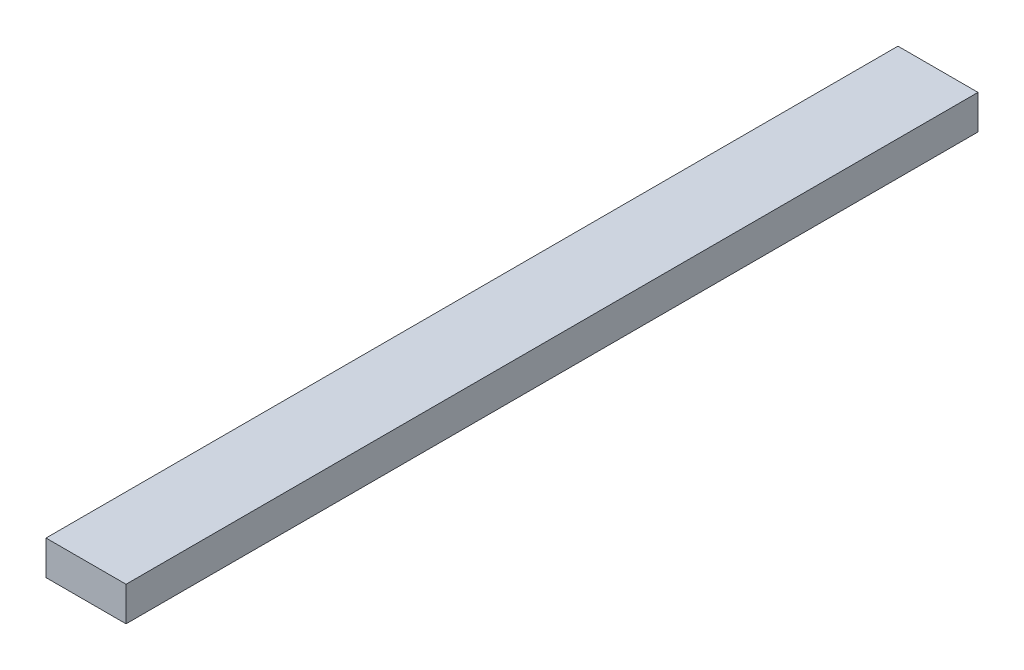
ISO-10303-21;
HEADER;
FILE_DESCRIPTION(('STEP AP214'),'2;1');
FILE_NAME('part.step','',(''),(''),'','','');
FILE_SCHEMA(('AUTOMOTIVE_DESIGN { 1 0 10303 214 1 1 1 1 }'));
ENDSEC;
DATA;
#1=APPLICATION_CONTEXT('core data for automotive mechanical design processes');
#2=APPLICATION_PROTOCOL_DEFINITION('international standard','automotive_design',2000,#1);
#3=PRODUCT_CONTEXT('',#1,'mechanical');
#4=PRODUCT('Part','Part','',(#3));
#5=PRODUCT_RELATED_PRODUCT_CATEGORY('part','',(#4));
#6=PRODUCT_DEFINITION_FORMATION('','',#4);
#7=PRODUCT_DEFINITION_CONTEXT('part definition',#1,'design');
#8=PRODUCT_DEFINITION('design','',#6,#7);
#9=PRODUCT_DEFINITION_SHAPE('','',#8);
#10=(LENGTH_UNIT() NAMED_UNIT(*) SI_UNIT(.MILLI.,.METRE.));
#11=(NAMED_UNIT(*) PLANE_ANGLE_UNIT() SI_UNIT($,.RADIAN.));
#12=(NAMED_UNIT(*) SI_UNIT($,.STERADIAN.) SOLID_ANGLE_UNIT());
#13=UNCERTAINTY_MEASURE_WITH_UNIT(LENGTH_MEASURE(1.E-05),#10,'distance_accuracy_value','');
#14=(GEOMETRIC_REPRESENTATION_CONTEXT(3) GLOBAL_UNCERTAINTY_ASSIGNED_CONTEXT((#13)) GLOBAL_UNIT_ASSIGNED_CONTEXT((#10,
#11,#12)) REPRESENTATION_CONTEXT('',''));
#15=CARTESIAN_POINT('',(0.,0.,0.));
#16=DIRECTION('',(0.,0.,1.));
#17=DIRECTION('',(1.,0.,0.));
#18=AXIS2_PLACEMENT_3D('',#15,#16,#17);
#19=CARTESIAN_POINT('',(44.45,38.1,473.075));
#20=DIRECTION('',(-1.,0.,0.));
#21=DIRECTION('',(0.,0.,1.));
#22=AXIS2_PLACEMENT_3D('',#19,#20,#21);
#23=PLANE('',#22);
#24=DIRECTION('',(0.,0.,-1.));
#25=VECTOR('',#24,1.);
#26=CARTESIAN_POINT('',(44.45,0.,473.075));
#27=LINE('',#26,#25);
#28=CARTESIAN_POINT('',(44.45,0.,473.075));
#29=VERTEX_POINT('',#28);
#30=CARTESIAN_POINT('',(44.45,0.,-473.075));
#31=VERTEX_POINT('',#30);
#32=EDGE_CURVE('E96',#29,#31,#27,.T.);
#33=ORIENTED_EDGE('',*,*,#32,.T.);
#34=DIRECTION('',(0.,-1.,0.));
#35=VECTOR('',#34,1.);
#36=CARTESIAN_POINT('',(44.45,38.1,-473.075));
#37=LINE('',#36,#35);
#38=CARTESIAN_POINT('',(44.45,38.1,-473.075));
#39=VERTEX_POINT('',#38);
#40=EDGE_CURVE('E11',#39,#31,#37,.T.);
#41=ORIENTED_EDGE('',*,*,#40,.F.);
#42=DIRECTION('',(0.,0.,-1.));
#43=VECTOR('',#42,1.);
#44=CARTESIAN_POINT('',(44.45,38.1,473.075));
#45=LINE('',#44,#43);
#46=CARTESIAN_POINT('',(44.45,38.1,473.075));
#47=VERTEX_POINT('',#46);
#48=EDGE_CURVE('E84',#47,#39,#45,.T.);
#49=ORIENTED_EDGE('',*,*,#48,.F.);
#50=DIRECTION('',(0.,-1.,0.));
#51=VECTOR('',#50,1.);
#52=CARTESIAN_POINT('',(44.45,38.1,473.075));
#53=LINE('',#52,#51);
#54=EDGE_CURVE('E92',#47,#29,#53,.T.);
#55=ORIENTED_EDGE('',*,*,#54,.T.);
#56=EDGE_LOOP('',(#33,#41,#49,#55));
#57=FACE_BOUND('',#56,.T.);
#58=ADVANCED_FACE('F33',(#57),#23,.F.);
#59=CARTESIAN_POINT('',(-44.45,38.1,-473.075));
#60=DIRECTION('',(0.,0.,1.));
#61=DIRECTION('',(1.,0.,0.));
#62=AXIS2_PLACEMENT_3D('',#59,#60,#61);
#63=PLANE('',#62);
#64=DIRECTION('',(-1.,0.,0.));
#65=VECTOR('',#64,1.);
#66=CARTESIAN_POINT('',(-44.45,0.,-473.075));
#67=LINE('',#66,#65);
#68=CARTESIAN_POINT('',(-44.45,0.,-473.075));
#69=VERTEX_POINT('',#68);
#70=EDGE_CURVE('E88',#31,#69,#67,.T.);
#71=ORIENTED_EDGE('',*,*,#70,.T.);
#72=DIRECTION('',(0.,-1.,0.));
#73=VECTOR('',#72,1.);
#74=CARTESIAN_POINT('',(-44.45,38.1,-473.075));
#75=LINE('',#74,#73);
#76=CARTESIAN_POINT('',(-44.45,38.1,-473.075));
#77=VERTEX_POINT('',#76);
#78=EDGE_CURVE('E41',#77,#69,#75,.T.);
#79=ORIENTED_EDGE('',*,*,#78,.F.);
#80=DIRECTION('',(-1.,0.,0.));
#81=VECTOR('',#80,1.);
#82=CARTESIAN_POINT('',(-44.45,38.1,-473.075));
#83=LINE('',#82,#81);
#84=EDGE_CURVE('E79',#39,#77,#83,.T.);
#85=ORIENTED_EDGE('',*,*,#84,.F.);
#86=ORIENTED_EDGE('',*,*,#40,.T.);
#87=EDGE_LOOP('',(#71,#79,#85,#86));
#88=FACE_BOUND('',#87,.T.);
#89=ADVANCED_FACE('F87',(#88),#63,.F.);
#90=CARTESIAN_POINT('',(-44.45,38.1,473.075));
#91=DIRECTION('',(1.,0.,0.));
#92=DIRECTION('',(0.,0.,-1.));
#93=AXIS2_PLACEMENT_3D('',#90,#91,#92);
#94=PLANE('',#93);
#95=DIRECTION('',(0.,0.,1.));
#96=VECTOR('',#95,1.);
#97=CARTESIAN_POINT('',(-44.45,0.,473.075));
#98=LINE('',#97,#96);
#99=CARTESIAN_POINT('',(-44.45,0.,473.075));
#100=VERTEX_POINT('',#99);
#101=EDGE_CURVE('E66',#69,#100,#98,.T.);
#102=ORIENTED_EDGE('',*,*,#101,.T.);
#103=DIRECTION('',(0.,-1.,0.));
#104=VECTOR('',#103,1.);
#105=CARTESIAN_POINT('',(-44.45,38.1,473.075));
#106=LINE('',#105,#104);
#107=CARTESIAN_POINT('',(-44.45,38.1,473.075));
#108=VERTEX_POINT('',#107);
#109=EDGE_CURVE('E89',#108,#100,#106,.T.);
#110=ORIENTED_EDGE('',*,*,#109,.F.);
#111=DIRECTION('',(0.,0.,1.));
#112=VECTOR('',#111,1.);
#113=CARTESIAN_POINT('',(-44.45,38.1,473.075));
#114=LINE('',#113,#112);
#115=EDGE_CURVE('E82',#77,#108,#114,.T.);
#116=ORIENTED_EDGE('',*,*,#115,.F.);
#117=ORIENTED_EDGE('',*,*,#78,.T.);
#118=EDGE_LOOP('',(#102,#110,#116,#117));
#119=FACE_BOUND('',#118,.T.);
#120=ADVANCED_FACE('F90',(#119),#94,.F.);
#121=CARTESIAN_POINT('',(-44.45,38.1,473.075));
#122=DIRECTION('',(0.,0.,-1.));
#123=DIRECTION('',(-1.,0.,0.));
#124=AXIS2_PLACEMENT_3D('',#121,#122,#123);
#125=PLANE('',#124);
#126=DIRECTION('',(1.,0.,0.));
#127=VECTOR('',#126,1.);
#128=CARTESIAN_POINT('',(-44.45,0.,473.075));
#129=LINE('',#128,#127);
#130=EDGE_CURVE('E72',#100,#29,#129,.T.);
#131=ORIENTED_EDGE('',*,*,#130,.T.);
#132=ORIENTED_EDGE('',*,*,#54,.F.);
#133=DIRECTION('',(1.,0.,0.));
#134=VECTOR('',#133,1.);
#135=CARTESIAN_POINT('',(-44.45,38.1,473.075));
#136=LINE('',#135,#134);
#137=EDGE_CURVE('E49',#108,#47,#136,.T.);
#138=ORIENTED_EDGE('',*,*,#137,.F.);
#139=ORIENTED_EDGE('',*,*,#109,.T.);
#140=EDGE_LOOP('',(#131,#132,#138,#139));
#141=FACE_BOUND('',#140,.T.);
#142=ADVANCED_FACE('F103',(#141),#125,.F.);
#143=CARTESIAN_POINT('',(0.,38.1,0.));
#144=DIRECTION('',(0.,-1.,0.));
#145=DIRECTION('',(0.,0.,-1.));
#146=AXIS2_PLACEMENT_3D('',#143,#144,#145);
#147=PLANE('',#146);
#148=ORIENTED_EDGE('',*,*,#48,.T.);
#149=ORIENTED_EDGE('',*,*,#84,.T.);
#150=ORIENTED_EDGE('',*,*,#115,.T.);
#151=ORIENTED_EDGE('',*,*,#137,.T.);
#152=EDGE_LOOP('',(#148,#149,#150,#151));
#153=FACE_BOUND('',#152,.T.);
#154=ADVANCED_FACE('F80',(#153),#147,.F.);
#155=CARTESIAN_POINT('',(0.,0.,0.));
#156=DIRECTION('',(0.,-1.,0.));
#157=DIRECTION('',(0.,0.,-1.));
#158=AXIS2_PLACEMENT_3D('',#155,#156,#157);
#159=PLANE('',#158);
#160=ORIENTED_EDGE('',*,*,#32,.F.);
#161=ORIENTED_EDGE('',*,*,#130,.F.);
#162=ORIENTED_EDGE('',*,*,#101,.F.);
#163=ORIENTED_EDGE('',*,*,#70,.F.);
#164=EDGE_LOOP('',(#160,#161,#162,#163));
#165=FACE_BOUND('',#164,.T.);
#166=ADVANCED_FACE('F106',(#165),#159,.T.);
#167=CLOSED_SHELL('',(#58,#89,#120,#142,#154,#166));
#168=MANIFOLD_SOLID_BREP('B2',#167);
#169=ADVANCED_BREP_SHAPE_REPRESENTATION('',(#18,#168),#14);
#170=SHAPE_DEFINITION_REPRESENTATION(#9,#169);
ENDSEC;
END-ISO-10303-21;
